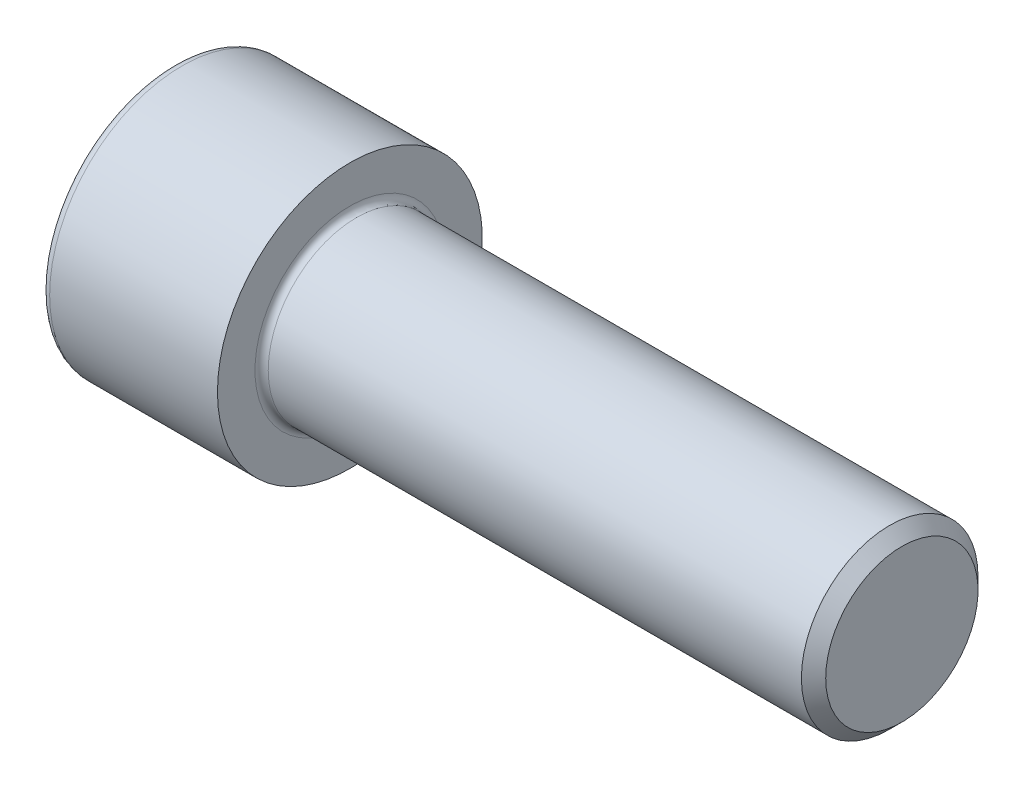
ISO-10303-21;
HEADER;
FILE_DESCRIPTION(('STEP AP214'),'2;1');
FILE_NAME('part.step','',(''),(''),'','','');
FILE_SCHEMA(('AUTOMOTIVE_DESIGN { 1 0 10303 214 1 1 1 1 }'));
ENDSEC;
DATA;
#1=APPLICATION_CONTEXT('core data for automotive mechanical design processes');
#2=APPLICATION_PROTOCOL_DEFINITION('international standard','automotive_design',2000,#1);
#3=PRODUCT_CONTEXT('',#1,'mechanical');
#4=PRODUCT('Part','Part','',(#3));
#5=PRODUCT_RELATED_PRODUCT_CATEGORY('part','',(#4));
#6=PRODUCT_DEFINITION_FORMATION('','',#4);
#7=PRODUCT_DEFINITION_CONTEXT('part definition',#1,'design');
#8=PRODUCT_DEFINITION('design','',#6,#7);
#9=PRODUCT_DEFINITION_SHAPE('','',#8);
#10=(LENGTH_UNIT() NAMED_UNIT(*) SI_UNIT(.MILLI.,.METRE.));
#11=(NAMED_UNIT(*) PLANE_ANGLE_UNIT() SI_UNIT($,.RADIAN.));
#12=(NAMED_UNIT(*) SI_UNIT($,.STERADIAN.) SOLID_ANGLE_UNIT());
#13=UNCERTAINTY_MEASURE_WITH_UNIT(LENGTH_MEASURE(1.E-05),#10,'distance_accuracy_value','');
#14=(GEOMETRIC_REPRESENTATION_CONTEXT(3) GLOBAL_UNCERTAINTY_ASSIGNED_CONTEXT((#13)) GLOBAL_UNIT_ASSIGNED_CONTEXT((#10,
#11,#12)) REPRESENTATION_CONTEXT('',''));
#15=CARTESIAN_POINT('',(0.,0.,0.));
#16=DIRECTION('',(0.,0.,1.));
#17=DIRECTION('',(1.,0.,0.));
#18=AXIS2_PLACEMENT_3D('',#15,#16,#17);
#19=CARTESIAN_POINT('',(0.,0.,0.));
#20=DIRECTION('',(-1.,0.,0.));
#21=DIRECTION('',(0.,0.,1.));
#22=AXIS2_PLACEMENT_3D('',#19,#20,#21);
#23=PLANE('',#22);
#24=DIRECTION('',(0.,-0.499999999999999,0.866025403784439));
#25=VECTOR('',#24,1.);
#26=CARTESIAN_POINT('',(0.,8.16488750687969,0.));
#27=LINE('',#26,#25);
#28=CARTESIAN_POINT('',(0.,8.16488750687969,0.));
#29=VERTEX_POINT('',#28);
#30=CARTESIAN_POINT('',(0.,4.08244375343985,7.07099999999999));
#31=VERTEX_POINT('',#30);
#32=EDGE_CURVE('E266',#29,#31,#27,.T.);
#33=ORIENTED_EDGE('',*,*,#32,.T.);
#34=DIRECTION('',(0.,1.,0.));
#35=VECTOR('',#34,1.);
#36=CARTESIAN_POINT('',(0.,-4.08244375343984,7.071));
#37=LINE('',#36,#35);
#38=CARTESIAN_POINT('',(0.,-4.08244375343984,7.071));
#39=VERTEX_POINT('',#38);
#40=EDGE_CURVE('E142',#39,#31,#37,.T.);
#41=ORIENTED_EDGE('',*,*,#40,.F.);
#42=DIRECTION('',(0.,-0.500000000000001,-0.866025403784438));
#43=VECTOR('',#42,1.);
#44=CARTESIAN_POINT('',(0.,-4.08244375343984,7.071));
#45=LINE('',#44,#43);
#46=CARTESIAN_POINT('',(0.,-8.16488750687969,0.));
#47=VERTEX_POINT('',#46);
#48=EDGE_CURVE('E269',#39,#47,#45,.T.);
#49=ORIENTED_EDGE('',*,*,#48,.T.);
#50=DIRECTION('',(0.,0.499999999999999,-0.866025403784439));
#51=VECTOR('',#50,1.);
#52=CARTESIAN_POINT('',(0.,-8.16488750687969,0.));
#53=LINE('',#52,#51);
#54=CARTESIAN_POINT('',(0.,-4.08244375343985,-7.071));
#55=VERTEX_POINT('',#54);
#56=EDGE_CURVE('E272',#47,#55,#53,.T.);
#57=ORIENTED_EDGE('',*,*,#56,.T.);
#58=DIRECTION('',(0.,-1.,0.));
#59=VECTOR('',#58,1.);
#60=CARTESIAN_POINT('',(0.,4.08244375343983,-7.07100000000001));
#61=LINE('',#60,#59);
#62=CARTESIAN_POINT('',(0.,4.08244375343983,-7.07100000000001));
#63=VERTEX_POINT('',#62);
#64=EDGE_CURVE('E275',#63,#55,#61,.T.);
#65=ORIENTED_EDGE('',*,*,#64,.F.);
#66=DIRECTION('',(0.,-0.500000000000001,-0.866025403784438));
#67=VECTOR('',#66,1.);
#68=CARTESIAN_POINT('',(0.,8.16488750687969,0.));
#69=LINE('',#68,#67);
#70=EDGE_CURVE('E137',#29,#63,#69,.T.);
#71=ORIENTED_EDGE('',*,*,#70,.F.);
#72=EDGE_LOOP('',(#33,#41,#49,#57,#65,#71));
#73=FACE_BOUND('',#72,.T.);
#74=CARTESIAN_POINT('',(0.,0.,0.));
#75=DIRECTION('',(-1.,0.,0.));
#76=DIRECTION('',(0.,0.,1.));
#77=AXIS2_PLACEMENT_3D('',#74,#75,#76);
#78=CIRCLE('',#77,11.2);
#79=CARTESIAN_POINT('',(0.,0.,11.2));
#80=VERTEX_POINT('',#79);
#81=EDGE_CURVE('E54',#80,#80,#78,.T.);
#82=ORIENTED_EDGE('',*,*,#81,.T.);
#83=EDGE_LOOP('',(#82));
#84=FACE_BOUND('',#83,.T.);
#85=ADVANCED_FACE('F46',(#73,#84),#23,.T.);
#86=CARTESIAN_POINT('',(-31.75,0.,0.));
#87=DIRECTION('',(-1.,0.,0.));
#88=DIRECTION('',(0.,0.,1.));
#89=AXIS2_PLACEMENT_3D('',#86,#87,#88);
#90=CYLINDRICAL_SURFACE('',#89,12.);
#91=CARTESIAN_POINT('',(0.800000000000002,0.,0.));
#92=DIRECTION('',(-1.,0.,0.));
#93=DIRECTION('',(0.,0.,1.));
#94=AXIS2_PLACEMENT_3D('',#91,#92,#93);
#95=CIRCLE('',#94,12.);
#96=CARTESIAN_POINT('',(0.800000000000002,0.,12.));
#97=VERTEX_POINT('',#96);
#98=EDGE_CURVE('E13',#97,#97,#95,.F.);
#99=ORIENTED_EDGE('',*,*,#98,.T.);
#100=EDGE_LOOP('',(#99));
#101=FACE_BOUND('',#100,.T.);
#102=CARTESIAN_POINT('',(16.,0.,0.));
#103=DIRECTION('',(-1.,0.,0.));
#104=DIRECTION('',(0.,0.,1.));
#105=AXIS2_PLACEMENT_3D('',#102,#103,#104);
#106=CIRCLE('',#105,12.);
#107=CARTESIAN_POINT('',(16.,0.,12.));
#108=VERTEX_POINT('',#107);
#109=EDGE_CURVE('E160',#108,#108,#106,.T.);
#110=ORIENTED_EDGE('',*,*,#109,.T.);
#111=EDGE_LOOP('',(#110));
#112=FACE_BOUND('',#111,.T.);
#113=ADVANCED_FACE('F184',(#101,#112),#90,.T.);
#114=CARTESIAN_POINT('',(16.,12.,0.));
#115=DIRECTION('',(1.,0.,0.));
#116=DIRECTION('',(0.,0.,-1.));
#117=AXIS2_PLACEMENT_3D('',#114,#115,#116);
#118=PLANE('',#117);
#119=CARTESIAN_POINT('',(16.,0.,0.));
#120=DIRECTION('',(1.,0.,0.));
#121=DIRECTION('',(0.,0.,-1.));
#122=AXIS2_PLACEMENT_3D('',#119,#120,#121);
#123=CIRCLE('',#122,8.6);
#124=CARTESIAN_POINT('',(16.,0.,-8.6));
#125=VERTEX_POINT('',#124);
#126=EDGE_CURVE('E163',#125,#125,#123,.F.);
#127=ORIENTED_EDGE('',*,*,#126,.T.);
#128=EDGE_LOOP('',(#127));
#129=FACE_BOUND('',#128,.T.);
#130=ORIENTED_EDGE('',*,*,#109,.F.);
#131=EDGE_LOOP('',(#130));
#132=FACE_BOUND('',#131,.T.);
#133=ADVANCED_FACE('F190',(#129,#132),#118,.T.);
#134=CARTESIAN_POINT('',(-31.75,0.,0.));
#135=DIRECTION('',(-1.,0.,0.));
#136=DIRECTION('',(0.,0.,1.));
#137=AXIS2_PLACEMENT_3D('',#134,#135,#136);
#138=CYLINDRICAL_SURFACE('',#137,8.);
#139=CARTESIAN_POINT('',(16.6,0.,0.));
#140=DIRECTION('',(1.,0.,0.));
#141=DIRECTION('',(0.,0.,-1.));
#142=AXIS2_PLACEMENT_3D('',#139,#140,#141);
#143=CIRCLE('',#142,8.);
#144=CARTESIAN_POINT('',(16.6,0.,-8.));
#145=VERTEX_POINT('',#144);
#146=EDGE_CURVE('E166',#145,#145,#143,.T.);
#147=ORIENTED_EDGE('',*,*,#146,.T.);
#148=EDGE_LOOP('',(#147));
#149=FACE_BOUND('',#148,.T.);
#150=CARTESIAN_POINT('',(64.8985,0.,0.));
#151=DIRECTION('',(-1.,0.,0.));
#152=DIRECTION('',(0.,0.,1.));
#153=AXIS2_PLACEMENT_3D('',#150,#151,#152);
#154=CIRCLE('',#153,8.);
#155=CARTESIAN_POINT('',(64.8985,0.,8.));
#156=VERTEX_POINT('',#155);
#157=EDGE_CURVE('E157',#156,#156,#154,.T.);
#158=ORIENTED_EDGE('',*,*,#157,.T.);
#159=EDGE_LOOP('',(#158));
#160=FACE_BOUND('',#159,.T.);
#161=ADVANCED_FACE('F196',(#149,#160),#138,.T.);
#162=CARTESIAN_POINT('',(66.,0.,0.));
#163=DIRECTION('',(-1.,0.,0.));
#164=DIRECTION('',(0.,0.,1.));
#165=AXIS2_PLACEMENT_3D('',#162,#163,#164);
#166=CONICAL_SURFACE('',#165,6.8985,0.785398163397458);
#167=ORIENTED_EDGE('',*,*,#157,.F.);
#168=EDGE_LOOP('',(#167));
#169=FACE_BOUND('',#168,.T.);
#170=CARTESIAN_POINT('',(66.,0.,0.));
#171=DIRECTION('',(-1.,0.,0.));
#172=DIRECTION('',(0.,0.,1.));
#173=AXIS2_PLACEMENT_3D('',#170,#171,#172);
#174=CIRCLE('',#173,6.8985);
#175=CARTESIAN_POINT('',(66.,0.,6.8985));
#176=VERTEX_POINT('',#175);
#177=EDGE_CURVE('E153',#176,#176,#174,.T.);
#178=ORIENTED_EDGE('',*,*,#177,.T.);
#179=EDGE_LOOP('',(#178));
#180=FACE_BOUND('',#179,.T.);
#181=ADVANCED_FACE('F200',(#169,#180),#166,.T.);
#182=CARTESIAN_POINT('',(66.,6.8985,0.));
#183=DIRECTION('',(1.,0.,0.));
#184=DIRECTION('',(0.,0.,-1.));
#185=AXIS2_PLACEMENT_3D('',#182,#183,#184);
#186=PLANE('',#185);
#187=ORIENTED_EDGE('',*,*,#177,.F.);
#188=EDGE_LOOP('',(#187));
#189=FACE_BOUND('',#188,.T.);
#190=ADVANCED_FACE('F180',(#189),#186,.T.);
#191=CARTESIAN_POINT('',(16.6,0.,0.));
#192=DIRECTION('',(1.,0.,0.));
#193=DIRECTION('',(0.,0.,-1.));
#194=AXIS2_PLACEMENT_3D('',#191,#192,#193);
#195=TOROIDAL_SURFACE('',#194,8.6,0.6);
#196=ORIENTED_EDGE('',*,*,#146,.F.);
#197=EDGE_LOOP('',(#196));
#198=FACE_BOUND('',#197,.T.);
#199=ORIENTED_EDGE('',*,*,#126,.F.);
#200=EDGE_LOOP('',(#199));
#201=FACE_BOUND('',#200,.T.);
#202=ADVANCED_FACE('F173',(#198,#201),#195,.F.);
#203=CARTESIAN_POINT('',(0.800000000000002,0.,0.));
#204=DIRECTION('',(-1.,0.,0.));
#205=DIRECTION('',(0.,0.,1.));
#206=AXIS2_PLACEMENT_3D('',#203,#204,#205);
#207=TOROIDAL_SURFACE('',#206,11.2,0.8);
#208=ORIENTED_EDGE('',*,*,#98,.F.);
#209=EDGE_LOOP('',(#208));
#210=FACE_BOUND('',#209,.T.);
#211=ORIENTED_EDGE('',*,*,#81,.F.);
#212=EDGE_LOOP('',(#211));
#213=FACE_BOUND('',#212,.T.);
#214=ADVANCED_FACE('F48',(#210,#213),#207,.T.);
#215=CARTESIAN_POINT('',(8.,8.16488750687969,0.));
#216=DIRECTION('',(0.,-0.866025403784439,-0.499999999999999));
#217=DIRECTION('',(0.,0.499999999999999,-0.866025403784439));
#218=AXIS2_PLACEMENT_3D('',#215,#216,#217);
#219=PLANE('',#218);
#220=ORIENTED_EDGE('',*,*,#32,.F.);
#221=DIRECTION('',(-1.,0.,0.));
#222=VECTOR('',#221,1.);
#223=CARTESIAN_POINT('',(8.,8.16488750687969,0.));
#224=LINE('',#223,#222);
#225=CARTESIAN_POINT('',(8.,8.16488750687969,0.));
#226=VERTEX_POINT('',#225);
#227=EDGE_CURVE('E256',#226,#29,#224,.T.);
#228=ORIENTED_EDGE('',*,*,#227,.F.);
#229=DIRECTION('',(0.,-0.499999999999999,0.866025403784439));
#230=VECTOR('',#229,1.);
#231=CARTESIAN_POINT('',(8.,8.16488750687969,0.));
#232=LINE('',#231,#230);
#233=CARTESIAN_POINT('',(8.,6.12366563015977,3.53549999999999));
#234=VERTEX_POINT('',#233);
#235=EDGE_CURVE('E129',#226,#234,#232,.T.);
#236=ORIENTED_EDGE('',*,*,#235,.T.);
#237=CARTESIAN_POINT('',(8.,4.08244375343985,7.07099999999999));
#238=VERTEX_POINT('',#237);
#239=EDGE_CURVE('E120',#234,#238,#232,.T.);
#240=ORIENTED_EDGE('',*,*,#239,.T.);
#241=DIRECTION('',(-1.,0.,0.));
#242=VECTOR('',#241,1.);
#243=CARTESIAN_POINT('',(8.,4.08244375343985,7.07099999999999));
#244=LINE('',#243,#242);
#245=EDGE_CURVE('E134',#238,#31,#244,.T.);
#246=ORIENTED_EDGE('',*,*,#245,.T.);
#247=EDGE_LOOP('',(#220,#228,#236,#240,#246));
#248=FACE_BOUND('',#247,.T.);
#249=ADVANCED_FACE('F133',(#248),#219,.T.);
#250=CARTESIAN_POINT('',(8.,-4.08244375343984,7.071));
#251=DIRECTION('',(0.,0.,1.));
#252=DIRECTION('',(0.,-1.,0.));
#253=AXIS2_PLACEMENT_3D('',#250,#251,#252);
#254=PLANE('',#253);
#255=ORIENTED_EDGE('',*,*,#40,.T.);
#256=ORIENTED_EDGE('',*,*,#245,.F.);
#257=DIRECTION('',(0.,1.,0.));
#258=VECTOR('',#257,1.);
#259=CARTESIAN_POINT('',(8.,-4.08244375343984,7.071));
#260=LINE('',#259,#258);
#261=CARTESIAN_POINT('',(8.,0.,7.071));
#262=VERTEX_POINT('',#261);
#263=EDGE_CURVE('E117',#262,#238,#260,.T.);
#264=ORIENTED_EDGE('',*,*,#263,.F.);
#265=CARTESIAN_POINT('',(8.,-4.08244375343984,7.071));
#266=VERTEX_POINT('',#265);
#267=EDGE_CURVE('E128',#266,#262,#260,.T.);
#268=ORIENTED_EDGE('',*,*,#267,.F.);
#269=DIRECTION('',(-1.,0.,0.));
#270=VECTOR('',#269,1.);
#271=CARTESIAN_POINT('',(8.,-4.08244375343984,7.071));
#272=LINE('',#271,#270);
#273=EDGE_CURVE('E144',#266,#39,#272,.T.);
#274=ORIENTED_EDGE('',*,*,#273,.T.);
#275=EDGE_LOOP('',(#255,#256,#264,#268,#274));
#276=FACE_BOUND('',#275,.T.);
#277=ADVANCED_FACE('F139',(#276),#254,.F.);
#278=CARTESIAN_POINT('',(8.,-4.08244375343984,7.071));
#279=DIRECTION('',(0.,0.866025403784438,-0.500000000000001));
#280=DIRECTION('',(0.,0.500000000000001,0.866025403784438));
#281=AXIS2_PLACEMENT_3D('',#278,#279,#280);
#282=PLANE('',#281);
#283=ORIENTED_EDGE('',*,*,#48,.F.);
#284=ORIENTED_EDGE('',*,*,#273,.F.);
#285=DIRECTION('',(0.,-0.500000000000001,-0.866025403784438));
#286=VECTOR('',#285,1.);
#287=CARTESIAN_POINT('',(8.,-4.08244375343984,7.071));
#288=LINE('',#287,#286);
#289=CARTESIAN_POINT('',(8.,-6.12366563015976,3.53550000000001));
#290=VERTEX_POINT('',#289);
#291=EDGE_CURVE('E295',#266,#290,#288,.T.);
#292=ORIENTED_EDGE('',*,*,#291,.T.);
#293=CARTESIAN_POINT('',(8.,-8.16488750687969,0.));
#294=VERTEX_POINT('',#293);
#295=EDGE_CURVE('E284',#290,#294,#288,.T.);
#296=ORIENTED_EDGE('',*,*,#295,.T.);
#297=DIRECTION('',(-1.,0.,0.));
#298=VECTOR('',#297,1.);
#299=CARTESIAN_POINT('',(8.,-8.16488750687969,0.));
#300=LINE('',#299,#298);
#301=EDGE_CURVE('E149',#294,#47,#300,.T.);
#302=ORIENTED_EDGE('',*,*,#301,.T.);
#303=EDGE_LOOP('',(#283,#284,#292,#296,#302));
#304=FACE_BOUND('',#303,.T.);
#305=ADVANCED_FACE('F212',(#304),#282,.T.);
#306=CARTESIAN_POINT('',(8.,-8.16488750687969,0.));
#307=DIRECTION('',(0.,0.866025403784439,0.499999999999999));
#308=DIRECTION('',(0.,-0.499999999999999,0.866025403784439));
#309=AXIS2_PLACEMENT_3D('',#306,#307,#308);
#310=PLANE('',#309);
#311=ORIENTED_EDGE('',*,*,#56,.F.);
#312=ORIENTED_EDGE('',*,*,#301,.F.);
#313=DIRECTION('',(0.,0.499999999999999,-0.866025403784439));
#314=VECTOR('',#313,1.);
#315=CARTESIAN_POINT('',(8.,-8.16488750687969,0.));
#316=LINE('',#315,#314);
#317=CARTESIAN_POINT('',(8.,-6.12366563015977,-3.53549999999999));
#318=VERTEX_POINT('',#317);
#319=EDGE_CURVE('E262',#294,#318,#316,.T.);
#320=ORIENTED_EDGE('',*,*,#319,.T.);
#321=CARTESIAN_POINT('',(8.,-4.08244375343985,-7.071));
#322=VERTEX_POINT('',#321);
#323=EDGE_CURVE('E294',#318,#322,#316,.T.);
#324=ORIENTED_EDGE('',*,*,#323,.T.);
#325=DIRECTION('',(-1.,0.,0.));
#326=VECTOR('',#325,1.);
#327=CARTESIAN_POINT('',(8.,-4.08244375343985,-7.071));
#328=LINE('',#327,#326);
#329=EDGE_CURVE('E255',#322,#55,#328,.T.);
#330=ORIENTED_EDGE('',*,*,#329,.T.);
#331=EDGE_LOOP('',(#311,#312,#320,#324,#330));
#332=FACE_BOUND('',#331,.T.);
#333=ADVANCED_FACE('F215',(#332),#310,.T.);
#334=CARTESIAN_POINT('',(8.,4.08244375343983,-7.07100000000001));
#335=DIRECTION('',(0.,0.,-1.));
#336=DIRECTION('',(0.,1.,0.));
#337=AXIS2_PLACEMENT_3D('',#334,#335,#336);
#338=PLANE('',#337);
#339=ORIENTED_EDGE('',*,*,#64,.T.);
#340=ORIENTED_EDGE('',*,*,#329,.F.);
#341=DIRECTION('',(0.,-1.,0.));
#342=VECTOR('',#341,1.);
#343=CARTESIAN_POINT('',(8.,4.08244375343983,-7.07100000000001));
#344=LINE('',#343,#342);
#345=CARTESIAN_POINT('',(8.,0.,-7.071));
#346=VERTEX_POINT('',#345);
#347=EDGE_CURVE('E259',#346,#322,#344,.T.);
#348=ORIENTED_EDGE('',*,*,#347,.F.);
#349=CARTESIAN_POINT('',(8.,4.08244375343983,-7.07100000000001));
#350=VERTEX_POINT('',#349);
#351=EDGE_CURVE('E61',#350,#346,#344,.T.);
#352=ORIENTED_EDGE('',*,*,#351,.F.);
#353=DIRECTION('',(-1.,0.,0.));
#354=VECTOR('',#353,1.);
#355=CARTESIAN_POINT('',(8.,4.08244375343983,-7.07100000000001));
#356=LINE('',#355,#354);
#357=EDGE_CURVE('E252',#350,#63,#356,.T.);
#358=ORIENTED_EDGE('',*,*,#357,.T.);
#359=EDGE_LOOP('',(#339,#340,#348,#352,#358));
#360=FACE_BOUND('',#359,.T.);
#361=ADVANCED_FACE('F219',(#360),#338,.F.);
#362=CARTESIAN_POINT('',(8.,8.16488750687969,0.));
#363=DIRECTION('',(0.,0.866025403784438,-0.500000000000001));
#364=DIRECTION('',(0.,0.500000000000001,0.866025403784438));
#365=AXIS2_PLACEMENT_3D('',#362,#363,#364);
#366=PLANE('',#365);
#367=ORIENTED_EDGE('',*,*,#70,.T.);
#368=ORIENTED_EDGE('',*,*,#357,.F.);
#369=DIRECTION('',(0.,-0.500000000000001,-0.866025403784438));
#370=VECTOR('',#369,1.);
#371=CARTESIAN_POINT('',(8.,8.16488750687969,0.));
#372=LINE('',#371,#370);
#373=CARTESIAN_POINT('',(8.,6.12366563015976,-3.53550000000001));
#374=VERTEX_POINT('',#373);
#375=EDGE_CURVE('E242',#374,#350,#372,.T.);
#376=ORIENTED_EDGE('',*,*,#375,.F.);
#377=EDGE_CURVE('E248',#226,#374,#372,.T.);
#378=ORIENTED_EDGE('',*,*,#377,.F.);
#379=ORIENTED_EDGE('',*,*,#227,.T.);
#380=EDGE_LOOP('',(#367,#368,#376,#378,#379));
#381=FACE_BOUND('',#380,.T.);
#382=ADVANCED_FACE('F223',(#381),#366,.F.);
#383=CARTESIAN_POINT('',(8.,8.16488750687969,0.));
#384=DIRECTION('',(1.,0.,0.));
#385=DIRECTION('',(0.,0.,-1.));
#386=AXIS2_PLACEMENT_3D('',#383,#384,#385);
#387=PLANE('',#386);
#388=ORIENTED_EDGE('',*,*,#347,.T.);
#389=ORIENTED_EDGE('',*,*,#323,.F.);
#390=CARTESIAN_POINT('',(8.,0.,0.));
#391=DIRECTION('',(-1.,0.,0.));
#392=DIRECTION('',(0.,0.,1.));
#393=AXIS2_PLACEMENT_3D('',#390,#391,#392);
#394=CIRCLE('',#393,7.071);
#395=EDGE_CURVE('E290',#346,#318,#394,.T.);
#396=ORIENTED_EDGE('',*,*,#395,.F.);
#397=EDGE_LOOP('',(#388,#389,#396));
#398=FACE_BOUND('',#397,.T.);
#399=ADVANCED_FACE('F227',(#398),#387,.F.);
#400=ORIENTED_EDGE('',*,*,#319,.F.);
#401=ORIENTED_EDGE('',*,*,#295,.F.);
#402=EDGE_CURVE('E147',#318,#290,#394,.T.);
#403=ORIENTED_EDGE('',*,*,#402,.F.);
#404=EDGE_LOOP('',(#400,#401,#403));
#405=FACE_BOUND('',#404,.T.);
#406=ADVANCED_FACE('F230',(#405),#387,.F.);
#407=ORIENTED_EDGE('',*,*,#291,.F.);
#408=ORIENTED_EDGE('',*,*,#267,.T.);
#409=EDGE_CURVE('E143',#290,#262,#394,.T.);
#410=ORIENTED_EDGE('',*,*,#409,.F.);
#411=EDGE_LOOP('',(#407,#408,#410));
#412=FACE_BOUND('',#411,.T.);
#413=ADVANCED_FACE('F234',(#412),#387,.F.);
#414=ORIENTED_EDGE('',*,*,#263,.T.);
#415=ORIENTED_EDGE('',*,*,#239,.F.);
#416=EDGE_CURVE('E123',#262,#234,#394,.T.);
#417=ORIENTED_EDGE('',*,*,#416,.F.);
#418=EDGE_LOOP('',(#414,#415,#417));
#419=FACE_BOUND('',#418,.T.);
#420=ADVANCED_FACE('F119',(#419),#387,.F.);
#421=ORIENTED_EDGE('',*,*,#235,.F.);
#422=ORIENTED_EDGE('',*,*,#377,.T.);
#423=EDGE_CURVE('E154',#234,#374,#394,.T.);
#424=ORIENTED_EDGE('',*,*,#423,.F.);
#425=EDGE_LOOP('',(#421,#422,#424));
#426=FACE_BOUND('',#425,.T.);
#427=ADVANCED_FACE('F237',(#426),#387,.F.);
#428=ORIENTED_EDGE('',*,*,#375,.T.);
#429=ORIENTED_EDGE('',*,*,#351,.T.);
#430=EDGE_CURVE('E245',#374,#346,#394,.T.);
#431=ORIENTED_EDGE('',*,*,#430,.F.);
#432=EDGE_LOOP('',(#428,#429,#431));
#433=FACE_BOUND('',#432,.T.);
#434=ADVANCED_FACE('F208',(#433),#387,.F.);
#435=CARTESIAN_POINT('',(8.,0.,0.));
#436=DIRECTION('',(-1.,0.,0.));
#437=DIRECTION('',(0.,0.,1.));
#438=AXIS2_PLACEMENT_3D('',#435,#436,#437);
#439=CONICAL_SURFACE('',#438,7.071,1.04719755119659);
#440=CARTESIAN_POINT('',(12.0824437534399,0.,0.));
#441=VERTEX_POINT('',#440);
#442=VERTEX_LOOP('',#441);
#443=FACE_BOUND('',#442,.T.);
#444=ORIENTED_EDGE('',*,*,#416,.T.);
#445=ORIENTED_EDGE('',*,*,#423,.T.);
#446=ORIENTED_EDGE('',*,*,#430,.T.);
#447=ORIENTED_EDGE('',*,*,#395,.T.);
#448=ORIENTED_EDGE('',*,*,#402,.T.);
#449=ORIENTED_EDGE('',*,*,#409,.T.);
#450=EDGE_LOOP('',(#444,#445,#446,#447,#448,#449));
#451=FACE_BOUND('',#450,.T.);
#452=ADVANCED_FACE('F207',(#443,#451),#439,.F.);
#453=CLOSED_SHELL('',(#85,#113,#133,#161,#181,#190,#202,#214,#249,#277,#305,#333,#361,#382,#399,
#406,#413,#420,#427,#434,#452));
#454=MANIFOLD_SOLID_BREP('B2',#453);
#455=ADVANCED_BREP_SHAPE_REPRESENTATION('',(#18,#454),#14);
#456=SHAPE_DEFINITION_REPRESENTATION(#9,#455);
ENDSEC;
END-ISO-10303-21;
